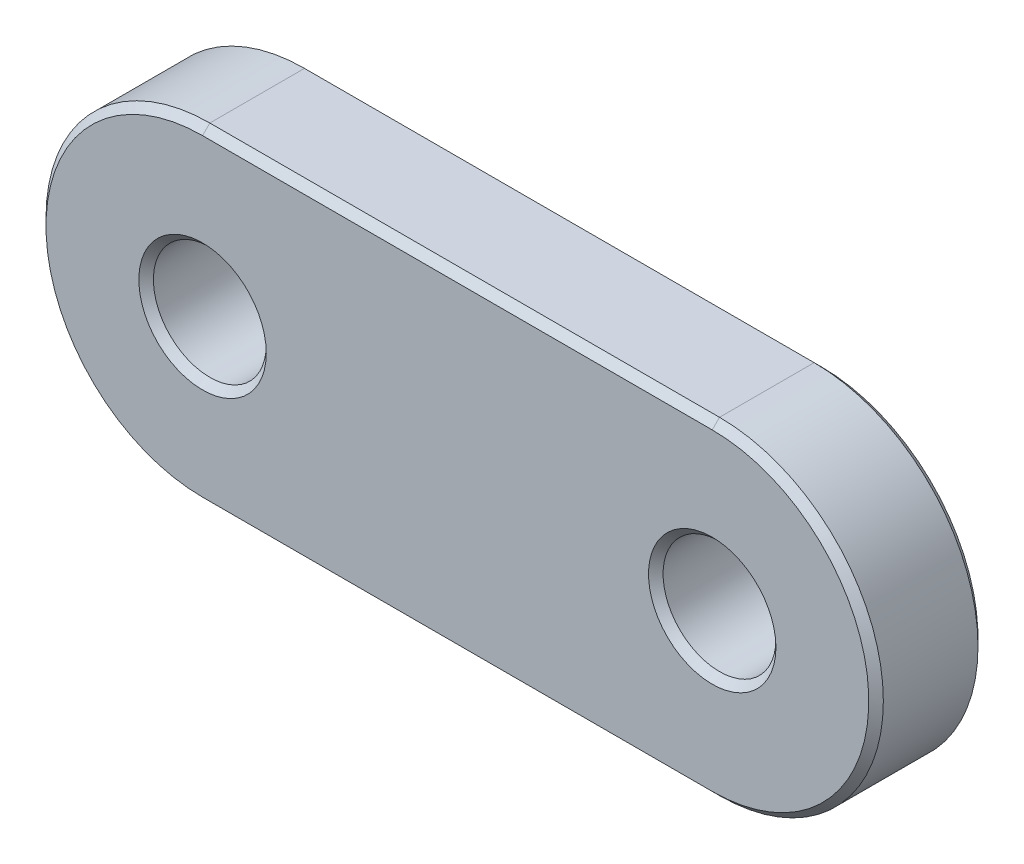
ISO-10303-21;
HEADER;
FILE_DESCRIPTION(('STEP AP214'),'2;1');
FILE_NAME('part.step','',(''),(''),'','','');
FILE_SCHEMA(('AUTOMOTIVE_DESIGN { 1 0 10303 214 1 1 1 1 }'));
ENDSEC;
DATA;
#1=APPLICATION_CONTEXT('core data for automotive mechanical design processes');
#2=APPLICATION_PROTOCOL_DEFINITION('international standard','automotive_design',2000,#1);
#3=PRODUCT_CONTEXT('',#1,'mechanical');
#4=PRODUCT('Part','Part','',(#3));
#5=PRODUCT_RELATED_PRODUCT_CATEGORY('part','',(#4));
#6=PRODUCT_DEFINITION_FORMATION('','',#4);
#7=PRODUCT_DEFINITION_CONTEXT('part definition',#1,'design');
#8=PRODUCT_DEFINITION('design','',#6,#7);
#9=PRODUCT_DEFINITION_SHAPE('','',#8);
#10=(LENGTH_UNIT() NAMED_UNIT(*) SI_UNIT(.MILLI.,.METRE.));
#11=(NAMED_UNIT(*) PLANE_ANGLE_UNIT() SI_UNIT($,.RADIAN.));
#12=(NAMED_UNIT(*) SI_UNIT($,.STERADIAN.) SOLID_ANGLE_UNIT());
#13=UNCERTAINTY_MEASURE_WITH_UNIT(LENGTH_MEASURE(1.E-05),#10,'distance_accuracy_value','');
#14=(GEOMETRIC_REPRESENTATION_CONTEXT(3) GLOBAL_UNCERTAINTY_ASSIGNED_CONTEXT((#13)) GLOBAL_UNIT_ASSIGNED_CONTEXT((#10,
#11,#12)) REPRESENTATION_CONTEXT('',''));
#15=CARTESIAN_POINT('',(0.,0.,0.));
#16=DIRECTION('',(0.,0.,1.));
#17=DIRECTION('',(1.,0.,0.));
#18=AXIS2_PLACEMENT_3D('',#15,#16,#17);
#19=CARTESIAN_POINT('',(-7.,0.,1.5));
#20=DIRECTION('',(0.,0.,1.));
#21=DIRECTION('',(1.,0.,0.));
#22=AXIS2_PLACEMENT_3D('',#19,#20,#21);
#23=PLANE('',#22);
#24=CARTESIAN_POINT('',(7.,0.,1.5));
#25=DIRECTION('',(0.,0.,1.));
#26=DIRECTION('',(1.,0.,0.));
#27=AXIS2_PLACEMENT_3D('',#24,#25,#26);
#28=CIRCLE('',#27,1.75000000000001);
#29=CARTESIAN_POINT('',(8.75000000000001,0.,1.5));
#30=VERTEX_POINT('',#29);
#31=EDGE_CURVE('E11',#30,#30,#28,.F.);
#32=ORIENTED_EDGE('',*,*,#31,.T.);
#33=EDGE_LOOP('',(#32));
#34=FACE_BOUND('',#33,.T.);
#35=CARTESIAN_POINT('',(-7.,0.,1.5));
#36=DIRECTION('',(0.,0.,1.));
#37=DIRECTION('',(1.,0.,0.));
#38=AXIS2_PLACEMENT_3D('',#35,#36,#37);
#39=CIRCLE('',#38,1.75000000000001);
#40=CARTESIAN_POINT('',(-5.24999999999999,0.,1.5));
#41=VERTEX_POINT('',#40);
#42=EDGE_CURVE('E49',#41,#41,#39,.F.);
#43=ORIENTED_EDGE('',*,*,#42,.T.);
#44=EDGE_LOOP('',(#43));
#45=FACE_BOUND('',#44,.T.);
#46=CARTESIAN_POINT('',(-7.,0.,1.5));
#47=DIRECTION('',(0.,0.,1.));
#48=DIRECTION('',(1.,0.,0.));
#49=AXIS2_PLACEMENT_3D('',#46,#47,#48);
#50=CIRCLE('',#49,4.3);
#51=CARTESIAN_POINT('',(-7.,4.3,1.5));
#52=VERTEX_POINT('',#51);
#53=CARTESIAN_POINT('',(-7.,-4.3,1.5));
#54=VERTEX_POINT('',#53);
#55=EDGE_CURVE('E56',#52,#54,#50,.T.);
#56=ORIENTED_EDGE('',*,*,#55,.T.);
#57=DIRECTION('',(1.,0.,0.));
#58=VECTOR('',#57,1.);
#59=CARTESIAN_POINT('',(7.,-4.3,1.5));
#60=LINE('',#59,#58);
#61=CARTESIAN_POINT('',(7.,-4.3,1.5));
#62=VERTEX_POINT('',#61);
#63=EDGE_CURVE('E155',#54,#62,#60,.T.);
#64=ORIENTED_EDGE('',*,*,#63,.T.);
#65=CARTESIAN_POINT('',(7.,0.,1.5));
#66=DIRECTION('',(0.,0.,1.));
#67=DIRECTION('',(1.,0.,0.));
#68=AXIS2_PLACEMENT_3D('',#65,#66,#67);
#69=CIRCLE('',#68,4.3);
#70=CARTESIAN_POINT('',(7.,4.3,1.5));
#71=VERTEX_POINT('',#70);
#72=EDGE_CURVE('E138',#62,#71,#69,.T.);
#73=ORIENTED_EDGE('',*,*,#72,.T.);
#74=DIRECTION('',(-1.,0.,0.));
#75=VECTOR('',#74,1.);
#76=CARTESIAN_POINT('',(-7.,4.3,1.5));
#77=LINE('',#76,#75);
#78=EDGE_CURVE('E375',#71,#52,#77,.T.);
#79=ORIENTED_EDGE('',*,*,#78,.T.);
#80=EDGE_LOOP('',(#56,#64,#73,#79));
#81=FACE_BOUND('',#80,.T.);
#82=ADVANCED_FACE('F41',(#34,#45,#81),#23,.T.);
#83=CARTESIAN_POINT('',(-7.,0.,-1.5));
#84=DIRECTION('',(0.,0.,1.));
#85=DIRECTION('',(1.,0.,0.));
#86=AXIS2_PLACEMENT_3D('',#83,#84,#85);
#87=PLANE('',#86);
#88=CARTESIAN_POINT('',(-7.,0.,-1.5));
#89=DIRECTION('',(0.,0.,1.));
#90=DIRECTION('',(1.,0.,0.));
#91=AXIS2_PLACEMENT_3D('',#88,#89,#90);
#92=CIRCLE('',#91,1.75000000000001);
#93=CARTESIAN_POINT('',(-5.24999999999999,0.,-1.5));
#94=VERTEX_POINT('',#93);
#95=EDGE_CURVE('E154',#94,#94,#92,.T.);
#96=ORIENTED_EDGE('',*,*,#95,.T.);
#97=EDGE_LOOP('',(#96));
#98=FACE_BOUND('',#97,.T.);
#99=CARTESIAN_POINT('',(7.,0.,-1.5));
#100=DIRECTION('',(0.,0.,1.));
#101=DIRECTION('',(1.,0.,0.));
#102=AXIS2_PLACEMENT_3D('',#99,#100,#101);
#103=CIRCLE('',#102,1.75);
#104=CARTESIAN_POINT('',(8.75,0.,-1.5));
#105=VERTEX_POINT('',#104);
#106=EDGE_CURVE('E151',#105,#105,#103,.T.);
#107=ORIENTED_EDGE('',*,*,#106,.T.);
#108=EDGE_LOOP('',(#107));
#109=FACE_BOUND('',#108,.T.);
#110=CARTESIAN_POINT('',(7.,0.,-1.5));
#111=DIRECTION('',(0.,0.,1.));
#112=DIRECTION('',(1.,0.,0.));
#113=AXIS2_PLACEMENT_3D('',#110,#111,#112);
#114=CIRCLE('',#113,4.3);
#115=CARTESIAN_POINT('',(7.,4.3,-1.5));
#116=VERTEX_POINT('',#115);
#117=CARTESIAN_POINT('',(7.,-4.3,-1.5));
#118=VERTEX_POINT('',#117);
#119=EDGE_CURVE('E334',#116,#118,#114,.F.);
#120=ORIENTED_EDGE('',*,*,#119,.T.);
#121=DIRECTION('',(-1.,0.,0.));
#122=VECTOR('',#121,1.);
#123=CARTESIAN_POINT('',(-7.,-4.3,-1.5));
#124=LINE('',#123,#122);
#125=CARTESIAN_POINT('',(-7.,-4.3,-1.5));
#126=VERTEX_POINT('',#125);
#127=EDGE_CURVE('E336',#118,#126,#124,.T.);
#128=ORIENTED_EDGE('',*,*,#127,.T.);
#129=CARTESIAN_POINT('',(-7.,0.,-1.5));
#130=DIRECTION('',(0.,0.,1.));
#131=DIRECTION('',(1.,0.,0.));
#132=AXIS2_PLACEMENT_3D('',#129,#130,#131);
#133=CIRCLE('',#132,4.3);
#134=CARTESIAN_POINT('',(-7.,4.3,-1.5));
#135=VERTEX_POINT('',#134);
#136=EDGE_CURVE('E342',#126,#135,#133,.F.);
#137=ORIENTED_EDGE('',*,*,#136,.T.);
#138=DIRECTION('',(1.,0.,0.));
#139=VECTOR('',#138,1.);
#140=CARTESIAN_POINT('',(-7.,4.3,-1.5));
#141=LINE('',#140,#139);
#142=EDGE_CURVE('E338',#135,#116,#141,.T.);
#143=ORIENTED_EDGE('',*,*,#142,.T.);
#144=EDGE_LOOP('',(#120,#128,#137,#143));
#145=FACE_BOUND('',#144,.T.);
#146=ADVANCED_FACE('F196',(#98,#109,#145),#87,.F.);
#147=CARTESIAN_POINT('',(-7.,0.,1.5));
#148=DIRECTION('',(0.,0.,-1.));
#149=DIRECTION('',(-1.,0.,0.));
#150=AXIS2_PLACEMENT_3D('',#147,#148,#149);
#151=CYLINDRICAL_SURFACE('',#150,4.5);
#152=DIRECTION('',(0.,0.,-1.));
#153=VECTOR('',#152,1.);
#154=CARTESIAN_POINT('',(-7.,4.5,1.5));
#155=LINE('',#154,#153);
#156=CARTESIAN_POINT('',(-7.,4.5,1.3));
#157=VERTEX_POINT('',#156);
#158=CARTESIAN_POINT('',(-7.,4.5,-1.3));
#159=VERTEX_POINT('',#158);
#160=EDGE_CURVE('E356',#157,#159,#155,.T.);
#161=ORIENTED_EDGE('',*,*,#160,.T.);
#162=CARTESIAN_POINT('',(-7.,0.,-1.3));
#163=DIRECTION('',(0.,0.,1.));
#164=DIRECTION('',(1.,0.,0.));
#165=AXIS2_PLACEMENT_3D('',#162,#163,#164);
#166=CIRCLE('',#165,4.5);
#167=CARTESIAN_POINT('',(-7.,-4.5,-1.3));
#168=VERTEX_POINT('',#167);
#169=EDGE_CURVE('E120',#159,#168,#166,.T.);
#170=ORIENTED_EDGE('',*,*,#169,.T.);
#171=DIRECTION('',(0.,0.,-1.));
#172=VECTOR('',#171,1.);
#173=CARTESIAN_POINT('',(-7.,-4.5,1.5));
#174=LINE('',#173,#172);
#175=CARTESIAN_POINT('',(-7.,-4.5,1.3));
#176=VERTEX_POINT('',#175);
#177=EDGE_CURVE('E131',#176,#168,#174,.T.);
#178=ORIENTED_EDGE('',*,*,#177,.F.);
#179=CARTESIAN_POINT('',(-7.,0.,1.3));
#180=DIRECTION('',(0.,0.,1.));
#181=DIRECTION('',(1.,0.,0.));
#182=AXIS2_PLACEMENT_3D('',#179,#180,#181);
#183=CIRCLE('',#182,4.5);
#184=EDGE_CURVE('E348',#176,#157,#183,.F.);
#185=ORIENTED_EDGE('',*,*,#184,.T.);
#186=EDGE_LOOP('',(#161,#170,#178,#185));
#187=FACE_BOUND('',#186,.T.);
#188=ADVANCED_FACE('F201',(#187),#151,.T.);
#189=CARTESIAN_POINT('',(7.,-4.5,1.5));
#190=DIRECTION('',(0.,1.,0.));
#191=DIRECTION('',(0.,0.,1.));
#192=AXIS2_PLACEMENT_3D('',#189,#190,#191);
#193=PLANE('',#192);
#194=ORIENTED_EDGE('',*,*,#177,.T.);
#195=DIRECTION('',(1.,0.,0.));
#196=VECTOR('',#195,1.);
#197=CARTESIAN_POINT('',(7.,-4.5,-1.3));
#198=LINE('',#197,#196);
#199=CARTESIAN_POINT('',(7.,-4.5,-1.3));
#200=VERTEX_POINT('',#199);
#201=EDGE_CURVE('E130',#168,#200,#198,.T.);
#202=ORIENTED_EDGE('',*,*,#201,.T.);
#203=DIRECTION('',(0.,0.,-1.));
#204=VECTOR('',#203,1.);
#205=CARTESIAN_POINT('',(7.,-4.5,1.5));
#206=LINE('',#205,#204);
#207=CARTESIAN_POINT('',(7.,-4.5,1.3));
#208=VERTEX_POINT('',#207);
#209=EDGE_CURVE('E113',#208,#200,#206,.T.);
#210=ORIENTED_EDGE('',*,*,#209,.F.);
#211=DIRECTION('',(-1.,0.,0.));
#212=VECTOR('',#211,1.);
#213=CARTESIAN_POINT('',(-7.,-4.5,1.3));
#214=LINE('',#213,#212);
#215=EDGE_CURVE('E127',#208,#176,#214,.T.);
#216=ORIENTED_EDGE('',*,*,#215,.T.);
#217=EDGE_LOOP('',(#194,#202,#210,#216));
#218=FACE_BOUND('',#217,.T.);
#219=ADVANCED_FACE('F126',(#218),#193,.F.);
#220=CARTESIAN_POINT('',(7.,0.,1.5));
#221=DIRECTION('',(0.,0.,-1.));
#222=DIRECTION('',(-1.,0.,0.));
#223=AXIS2_PLACEMENT_3D('',#220,#221,#222);
#224=CYLINDRICAL_SURFACE('',#223,4.5);
#225=ORIENTED_EDGE('',*,*,#209,.T.);
#226=CARTESIAN_POINT('',(7.,0.,-1.3));
#227=DIRECTION('',(0.,0.,1.));
#228=DIRECTION('',(1.,0.,0.));
#229=AXIS2_PLACEMENT_3D('',#226,#227,#228);
#230=CIRCLE('',#229,4.5);
#231=CARTESIAN_POINT('',(7.,4.5,-1.3));
#232=VERTEX_POINT('',#231);
#233=EDGE_CURVE('E119',#200,#232,#230,.T.);
#234=ORIENTED_EDGE('',*,*,#233,.T.);
#235=DIRECTION('',(0.,0.,-1.));
#236=VECTOR('',#235,1.);
#237=CARTESIAN_POINT('',(7.,4.5,1.5));
#238=LINE('',#237,#236);
#239=CARTESIAN_POINT('',(7.,4.5,1.3));
#240=VERTEX_POINT('',#239);
#241=EDGE_CURVE('E115',#240,#232,#238,.T.);
#242=ORIENTED_EDGE('',*,*,#241,.F.);
#243=CARTESIAN_POINT('',(7.,0.,1.3));
#244=DIRECTION('',(0.,0.,1.));
#245=DIRECTION('',(1.,0.,0.));
#246=AXIS2_PLACEMENT_3D('',#243,#244,#245);
#247=CIRCLE('',#246,4.5);
#248=EDGE_CURVE('E110',#240,#208,#247,.F.);
#249=ORIENTED_EDGE('',*,*,#248,.T.);
#250=EDGE_LOOP('',(#225,#234,#242,#249));
#251=FACE_BOUND('',#250,.T.);
#252=ADVANCED_FACE('F112',(#251),#224,.T.);
#253=CARTESIAN_POINT('',(7.,4.5,1.5));
#254=DIRECTION('',(0.,-1.,0.));
#255=DIRECTION('',(1.,0.,0.));
#256=AXIS2_PLACEMENT_3D('',#253,#254,#255);
#257=PLANE('',#256);
#258=ORIENTED_EDGE('',*,*,#241,.T.);
#259=DIRECTION('',(-1.,0.,0.));
#260=VECTOR('',#259,1.);
#261=CARTESIAN_POINT('',(7.,4.5,-1.3));
#262=LINE('',#261,#260);
#263=EDGE_CURVE('E373',#232,#159,#262,.T.);
#264=ORIENTED_EDGE('',*,*,#263,.T.);
#265=ORIENTED_EDGE('',*,*,#160,.F.);
#266=DIRECTION('',(1.,0.,0.));
#267=VECTOR('',#266,1.);
#268=CARTESIAN_POINT('',(7.,4.5,1.3));
#269=LINE('',#268,#267);
#270=EDGE_CURVE('E371',#157,#240,#269,.T.);
#271=ORIENTED_EDGE('',*,*,#270,.T.);
#272=EDGE_LOOP('',(#258,#264,#265,#271));
#273=FACE_BOUND('',#272,.T.);
#274=ADVANCED_FACE('F181',(#273),#257,.F.);
#275=CARTESIAN_POINT('',(-7.,0.,1.5));
#276=DIRECTION('',(0.,0.,-1.));
#277=DIRECTION('',(-1.,0.,0.));
#278=AXIS2_PLACEMENT_3D('',#275,#276,#277);
#279=CYLINDRICAL_SURFACE('',#278,1.55);
#280=CARTESIAN_POINT('',(-7.,0.,-1.3));
#281=DIRECTION('',(0.,0.,1.));
#282=DIRECTION('',(1.,0.,0.));
#283=AXIS2_PLACEMENT_3D('',#280,#281,#282);
#284=CIRCLE('',#283,1.55);
#285=CARTESIAN_POINT('',(-5.45,0.,-1.3));
#286=VERTEX_POINT('',#285);
#287=EDGE_CURVE('E161',#286,#286,#284,.F.);
#288=ORIENTED_EDGE('',*,*,#287,.T.);
#289=EDGE_LOOP('',(#288));
#290=FACE_BOUND('',#289,.T.);
#291=CARTESIAN_POINT('',(-7.,0.,1.3));
#292=DIRECTION('',(0.,0.,1.));
#293=DIRECTION('',(1.,0.,0.));
#294=AXIS2_PLACEMENT_3D('',#291,#292,#293);
#295=CIRCLE('',#294,1.55);
#296=CARTESIAN_POINT('',(-5.45,0.,1.3));
#297=VERTEX_POINT('',#296);
#298=EDGE_CURVE('E158',#297,#297,#295,.T.);
#299=ORIENTED_EDGE('',*,*,#298,.T.);
#300=EDGE_LOOP('',(#299));
#301=FACE_BOUND('',#300,.T.);
#302=ADVANCED_FACE('F178',(#290,#301),#279,.F.);
#303=CARTESIAN_POINT('',(7.,0.,1.5));
#304=DIRECTION('',(0.,0.,-1.));
#305=DIRECTION('',(-1.,0.,0.));
#306=AXIS2_PLACEMENT_3D('',#303,#304,#305);
#307=CYLINDRICAL_SURFACE('',#306,1.55);
#308=CARTESIAN_POINT('',(7.,0.,-1.3));
#309=DIRECTION('',(0.,0.,1.));
#310=DIRECTION('',(1.,0.,0.));
#311=AXIS2_PLACEMENT_3D('',#308,#309,#310);
#312=CIRCLE('',#311,1.55);
#313=CARTESIAN_POINT('',(8.55,0.,-1.3));
#314=VERTEX_POINT('',#313);
#315=EDGE_CURVE('E167',#314,#314,#312,.F.);
#316=ORIENTED_EDGE('',*,*,#315,.T.);
#317=EDGE_LOOP('',(#316));
#318=FACE_BOUND('',#317,.T.);
#319=CARTESIAN_POINT('',(7.,0.,1.3));
#320=DIRECTION('',(0.,0.,1.));
#321=DIRECTION('',(1.,0.,0.));
#322=AXIS2_PLACEMENT_3D('',#319,#320,#321);
#323=CIRCLE('',#322,1.55);
#324=CARTESIAN_POINT('',(8.55,0.,1.3));
#325=VERTEX_POINT('',#324);
#326=EDGE_CURVE('E164',#325,#325,#323,.T.);
#327=ORIENTED_EDGE('',*,*,#326,.T.);
#328=EDGE_LOOP('',(#327));
#329=FACE_BOUND('',#328,.T.);
#330=ADVANCED_FACE('F180',(#318,#329),#307,.F.);
#331=CARTESIAN_POINT('',(7.,4.5,-1.3));
#332=DIRECTION('',(0.,-0.707106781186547,0.707106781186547));
#333=DIRECTION('',(-1.,0.,0.));
#334=AXIS2_PLACEMENT_3D('',#331,#332,#333);
#335=PLANE('',#334);
#336=DIRECTION('',(0.,0.707106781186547,0.707106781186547));
#337=VECTOR('',#336,1.);
#338=CARTESIAN_POINT('',(7.,4.3,-1.5));
#339=LINE('',#338,#337);
#340=EDGE_CURVE('E351',#116,#232,#339,.T.);
#341=ORIENTED_EDGE('',*,*,#340,.F.);
#342=ORIENTED_EDGE('',*,*,#142,.F.);
#343=DIRECTION('',(0.,-0.707106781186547,-0.707106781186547));
#344=VECTOR('',#343,1.);
#345=CARTESIAN_POINT('',(-7.,4.5,-1.3));
#346=LINE('',#345,#344);
#347=EDGE_CURVE('E143',#159,#135,#346,.T.);
#348=ORIENTED_EDGE('',*,*,#347,.F.);
#349=ORIENTED_EDGE('',*,*,#263,.F.);
#350=EDGE_LOOP('',(#341,#342,#348,#349));
#351=FACE_BOUND('',#350,.T.);
#352=ADVANCED_FACE('F188',(#351),#335,.F.);
#353=CARTESIAN_POINT('',(-7.,0.,-1.3));
#354=DIRECTION('',(0.,0.,1.));
#355=DIRECTION('',(1.,0.,0.));
#356=AXIS2_PLACEMENT_3D('',#353,#354,#355);
#357=CONICAL_SURFACE('',#356,4.5,0.785398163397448);
#358=ORIENTED_EDGE('',*,*,#347,.T.);
#359=ORIENTED_EDGE('',*,*,#136,.F.);
#360=DIRECTION('',(0.,0.707106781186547,-0.707106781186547));
#361=VECTOR('',#360,1.);
#362=CARTESIAN_POINT('',(-7.,-4.5,-1.3));
#363=LINE('',#362,#361);
#364=EDGE_CURVE('E346',#168,#126,#363,.T.);
#365=ORIENTED_EDGE('',*,*,#364,.F.);
#366=ORIENTED_EDGE('',*,*,#169,.F.);
#367=EDGE_LOOP('',(#358,#359,#365,#366));
#368=FACE_BOUND('',#367,.T.);
#369=ADVANCED_FACE('F220',(#368),#357,.T.);
#370=CARTESIAN_POINT('',(7.,0.,-1.3));
#371=DIRECTION('',(0.,0.,1.));
#372=DIRECTION('',(1.,0.,0.));
#373=AXIS2_PLACEMENT_3D('',#370,#371,#372);
#374=CONICAL_SURFACE('',#373,4.5,0.785398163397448);
#375=ORIENTED_EDGE('',*,*,#340,.T.);
#376=ORIENTED_EDGE('',*,*,#233,.F.);
#377=DIRECTION('',(0.,-0.707106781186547,0.707106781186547));
#378=VECTOR('',#377,1.);
#379=CARTESIAN_POINT('',(7.,-4.3,-1.5));
#380=LINE('',#379,#378);
#381=EDGE_CURVE('E150',#118,#200,#380,.T.);
#382=ORIENTED_EDGE('',*,*,#381,.F.);
#383=ORIENTED_EDGE('',*,*,#119,.F.);
#384=EDGE_LOOP('',(#375,#376,#382,#383));
#385=FACE_BOUND('',#384,.T.);
#386=ADVANCED_FACE('F216',(#385),#374,.T.);
#387=CARTESIAN_POINT('',(7.,-4.5,-1.3));
#388=DIRECTION('',(0.,0.707106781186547,0.707106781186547));
#389=DIRECTION('',(1.,0.,0.));
#390=AXIS2_PLACEMENT_3D('',#387,#388,#389);
#391=PLANE('',#390);
#392=ORIENTED_EDGE('',*,*,#364,.T.);
#393=ORIENTED_EDGE('',*,*,#127,.F.);
#394=ORIENTED_EDGE('',*,*,#381,.T.);
#395=ORIENTED_EDGE('',*,*,#201,.F.);
#396=EDGE_LOOP('',(#392,#393,#394,#395));
#397=FACE_BOUND('',#396,.T.);
#398=ADVANCED_FACE('F212',(#397),#391,.F.);
#399=CARTESIAN_POINT('',(-7.,4.3,1.5));
#400=DIRECTION('',(0.,0.707106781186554,0.707106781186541));
#401=DIRECTION('',(1.,0.,0.));
#402=AXIS2_PLACEMENT_3D('',#399,#400,#401);
#403=PLANE('',#402);
#404=DIRECTION('',(0.,-0.707106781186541,0.707106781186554));
#405=VECTOR('',#404,1.);
#406=CARTESIAN_POINT('',(7.,4.5,1.3));
#407=LINE('',#406,#405);
#408=EDGE_CURVE('E140',#240,#71,#407,.T.);
#409=ORIENTED_EDGE('',*,*,#408,.F.);
#410=ORIENTED_EDGE('',*,*,#270,.F.);
#411=DIRECTION('',(0.,0.707106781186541,-0.707106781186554));
#412=VECTOR('',#411,1.);
#413=CARTESIAN_POINT('',(-7.,4.3,1.5));
#414=LINE('',#413,#412);
#415=EDGE_CURVE('E147',#52,#157,#414,.T.);
#416=ORIENTED_EDGE('',*,*,#415,.F.);
#417=ORIENTED_EDGE('',*,*,#78,.F.);
#418=EDGE_LOOP('',(#409,#410,#416,#417));
#419=FACE_BOUND('',#418,.T.);
#420=ADVANCED_FACE('F215',(#419),#403,.T.);
#421=CARTESIAN_POINT('',(-7.,0.,1.5));
#422=DIRECTION('',(0.,0.,-1.));
#423=DIRECTION('',(-1.,0.,0.));
#424=AXIS2_PLACEMENT_3D('',#421,#422,#423);
#425=CONICAL_SURFACE('',#424,4.3,0.78539816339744);
#426=ORIENTED_EDGE('',*,*,#415,.T.);
#427=ORIENTED_EDGE('',*,*,#184,.F.);
#428=DIRECTION('',(0.,-0.707106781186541,-0.707106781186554));
#429=VECTOR('',#428,1.);
#430=CARTESIAN_POINT('',(-7.,-4.3,1.5));
#431=LINE('',#430,#429);
#432=EDGE_CURVE('E134',#54,#176,#431,.T.);
#433=ORIENTED_EDGE('',*,*,#432,.F.);
#434=ORIENTED_EDGE('',*,*,#55,.F.);
#435=EDGE_LOOP('',(#426,#427,#433,#434));
#436=FACE_BOUND('',#435,.T.);
#437=ADVANCED_FACE('F232',(#436),#425,.T.);
#438=CARTESIAN_POINT('',(7.,0.,1.5));
#439=DIRECTION('',(0.,0.,-1.));
#440=DIRECTION('',(-1.,0.,0.));
#441=AXIS2_PLACEMENT_3D('',#438,#439,#440);
#442=CONICAL_SURFACE('',#441,4.3,0.78539816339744);
#443=ORIENTED_EDGE('',*,*,#408,.T.);
#444=ORIENTED_EDGE('',*,*,#72,.F.);
#445=DIRECTION('',(0.,0.707106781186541,0.707106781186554));
#446=VECTOR('',#445,1.);
#447=CARTESIAN_POINT('',(7.,-4.5,1.3));
#448=LINE('',#447,#446);
#449=EDGE_CURVE('E64',#208,#62,#448,.T.);
#450=ORIENTED_EDGE('',*,*,#449,.F.);
#451=ORIENTED_EDGE('',*,*,#248,.F.);
#452=EDGE_LOOP('',(#443,#444,#450,#451));
#453=FACE_BOUND('',#452,.T.);
#454=ADVANCED_FACE('F137',(#453),#442,.T.);
#455=CARTESIAN_POINT('',(-7.,-4.3,1.5));
#456=DIRECTION('',(0.,-0.707106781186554,0.707106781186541));
#457=DIRECTION('',(-1.,0.,0.));
#458=AXIS2_PLACEMENT_3D('',#455,#456,#457);
#459=PLANE('',#458);
#460=ORIENTED_EDGE('',*,*,#432,.T.);
#461=ORIENTED_EDGE('',*,*,#215,.F.);
#462=ORIENTED_EDGE('',*,*,#449,.T.);
#463=ORIENTED_EDGE('',*,*,#63,.F.);
#464=EDGE_LOOP('',(#460,#461,#462,#463));
#465=FACE_BOUND('',#464,.T.);
#466=ADVANCED_FACE('F133',(#465),#459,.T.);
#467=CARTESIAN_POINT('',(-7.,0.,-1.5));
#468=DIRECTION('',(0.,0.,-1.));
#469=DIRECTION('',(-1.,0.,0.));
#470=AXIS2_PLACEMENT_3D('',#467,#468,#469);
#471=CONICAL_SURFACE('',#470,1.75000000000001,0.785398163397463);
#472=ORIENTED_EDGE('',*,*,#287,.F.);
#473=EDGE_LOOP('',(#472));
#474=FACE_BOUND('',#473,.T.);
#475=ORIENTED_EDGE('',*,*,#95,.F.);
#476=EDGE_LOOP('',(#475));
#477=FACE_BOUND('',#476,.T.);
#478=ADVANCED_FACE('F229',(#474,#477),#471,.F.);
#479=CARTESIAN_POINT('',(7.,0.,-1.5));
#480=DIRECTION('',(0.,0.,-1.));
#481=DIRECTION('',(-1.,0.,0.));
#482=AXIS2_PLACEMENT_3D('',#479,#480,#481);
#483=CONICAL_SURFACE('',#482,1.75,0.785398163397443);
#484=ORIENTED_EDGE('',*,*,#315,.F.);
#485=EDGE_LOOP('',(#484));
#486=FACE_BOUND('',#485,.T.);
#487=ORIENTED_EDGE('',*,*,#106,.F.);
#488=EDGE_LOOP('',(#487));
#489=FACE_BOUND('',#488,.T.);
#490=ADVANCED_FACE('F241',(#486,#489),#483,.F.);
#491=CARTESIAN_POINT('',(7.,0.,1.3));
#492=DIRECTION('',(0.,0.,1.));
#493=DIRECTION('',(1.,0.,0.));
#494=AXIS2_PLACEMENT_3D('',#491,#492,#493);
#495=CONICAL_SURFACE('',#494,1.55,0.785398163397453);
#496=ORIENTED_EDGE('',*,*,#31,.F.);
#497=EDGE_LOOP('',(#496));
#498=FACE_BOUND('',#497,.T.);
#499=ORIENTED_EDGE('',*,*,#326,.F.);
#500=EDGE_LOOP('',(#499));
#501=FACE_BOUND('',#500,.T.);
#502=ADVANCED_FACE('F175',(#498,#501),#495,.F.);
#503=CARTESIAN_POINT('',(-7.,0.,1.3));
#504=DIRECTION('',(0.,0.,1.));
#505=DIRECTION('',(1.,0.,0.));
#506=AXIS2_PLACEMENT_3D('',#503,#504,#505);
#507=CONICAL_SURFACE('',#506,1.55,0.785398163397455);
#508=ORIENTED_EDGE('',*,*,#42,.F.);
#509=EDGE_LOOP('',(#508));
#510=FACE_BOUND('',#509,.T.);
#511=ORIENTED_EDGE('',*,*,#298,.F.);
#512=EDGE_LOOP('',(#511));
#513=FACE_BOUND('',#512,.T.);
#514=ADVANCED_FACE('F43',(#510,#513),#507,.F.);
#515=CLOSED_SHELL('',(#82,#146,#188,#219,#252,#274,#302,#330,#352,#369,#386,#398,#420,#437,#454,
#466,#478,#490,#502,#514));
#516=MANIFOLD_SOLID_BREP('B2',#515);
#517=ADVANCED_BREP_SHAPE_REPRESENTATION('',(#18,#516),#14);
#518=SHAPE_DEFINITION_REPRESENTATION(#9,#517);
ENDSEC;
END-ISO-10303-21;
